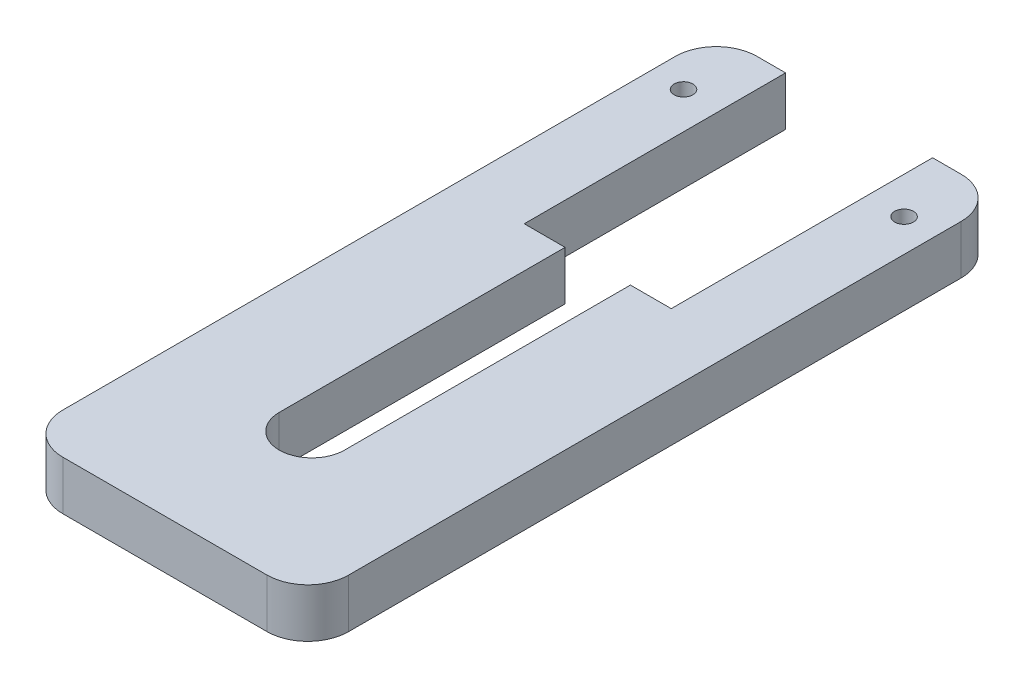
ISO-10303-21;
HEADER;
FILE_DESCRIPTION(('STEP AP214'),'2;1');
FILE_NAME('part.step','',(''),(''),'','','');
FILE_SCHEMA(('AUTOMOTIVE_DESIGN { 1 0 10303 214 1 1 1 1 }'));
ENDSEC;
DATA;
#1=APPLICATION_CONTEXT('core data for automotive mechanical design processes');
#2=APPLICATION_PROTOCOL_DEFINITION('international standard','automotive_design',2000,#1);
#3=PRODUCT_CONTEXT('',#1,'mechanical');
#4=PRODUCT('Part','Part','',(#3));
#5=PRODUCT_RELATED_PRODUCT_CATEGORY('part','',(#4));
#6=PRODUCT_DEFINITION_FORMATION('','',#4);
#7=PRODUCT_DEFINITION_CONTEXT('part definition',#1,'design');
#8=PRODUCT_DEFINITION('design','',#6,#7);
#9=PRODUCT_DEFINITION_SHAPE('','',#8);
#10=(LENGTH_UNIT() NAMED_UNIT(*) SI_UNIT(.MILLI.,.METRE.));
#11=(NAMED_UNIT(*) PLANE_ANGLE_UNIT() SI_UNIT($,.RADIAN.));
#12=(NAMED_UNIT(*) SI_UNIT($,.STERADIAN.) SOLID_ANGLE_UNIT());
#13=UNCERTAINTY_MEASURE_WITH_UNIT(LENGTH_MEASURE(1.E-05),#10,'distance_accuracy_value','');
#14=(GEOMETRIC_REPRESENTATION_CONTEXT(3) GLOBAL_UNCERTAINTY_ASSIGNED_CONTEXT((#13)) GLOBAL_UNIT_ASSIGNED_CONTEXT((#10,
#11,#12)) REPRESENTATION_CONTEXT('',''));
#15=CARTESIAN_POINT('',(0.,0.,0.));
#16=DIRECTION('',(0.,0.,1.));
#17=DIRECTION('',(1.,0.,0.));
#18=AXIS2_PLACEMENT_3D('',#15,#16,#17);
#19=CARTESIAN_POINT('',(-12.5,6.,-5.));
#20=DIRECTION('',(0.,1.,0.));
#21=DIRECTION('',(0.,0.,1.));
#22=AXIS2_PLACEMENT_3D('',#19,#20,#21);
#23=PLANE('',#22);
#24=CARTESIAN_POINT('',(-13.5,6.,-77.));
#25=DIRECTION('',(0.,1.,0.));
#26=DIRECTION('',(0.,0.,1.));
#27=AXIS2_PLACEMENT_3D('',#24,#25,#26);
#28=CIRCLE('',#27,1.15);
#29=CARTESIAN_POINT('',(-13.5,6.,-75.85));
#30=VERTEX_POINT('',#29);
#31=EDGE_CURVE('E182',#30,#30,#28,.T.);
#32=ORIENTED_EDGE('',*,*,#31,.F.);
#33=EDGE_LOOP('',(#32));
#34=FACE_BOUND('',#33,.T.);
#35=CARTESIAN_POINT('',(-12.5,6.,-5.));
#36=DIRECTION('',(0.,1.,0.));
#37=DIRECTION('',(0.,0.,1.));
#38=AXIS2_PLACEMENT_3D('',#35,#36,#37);
#39=CIRCLE('',#38,5.);
#40=CARTESIAN_POINT('',(-17.5,6.,-5.));
#41=VERTEX_POINT('',#40);
#42=CARTESIAN_POINT('',(-12.5,6.,0.));
#43=VERTEX_POINT('',#42);
#44=EDGE_CURVE('E209',#41,#43,#39,.T.);
#45=ORIENTED_EDGE('',*,*,#44,.T.);
#46=DIRECTION('',(1.,0.,0.));
#47=VECTOR('',#46,1.);
#48=CARTESIAN_POINT('',(-12.5,6.,0.));
#49=LINE('',#48,#47);
#50=CARTESIAN_POINT('',(12.5,6.,0.));
#51=VERTEX_POINT('',#50);
#52=EDGE_CURVE('E117',#43,#51,#49,.T.);
#53=ORIENTED_EDGE('',*,*,#52,.T.);
#54=CARTESIAN_POINT('',(12.5,6.,-5.));
#55=DIRECTION('',(0.,1.,0.));
#56=DIRECTION('',(0.,0.,1.));
#57=AXIS2_PLACEMENT_3D('',#54,#55,#56);
#58=CIRCLE('',#57,5.);
#59=CARTESIAN_POINT('',(17.5,6.,-5.));
#60=VERTEX_POINT('',#59);
#61=EDGE_CURVE('E248',#51,#60,#58,.T.);
#62=ORIENTED_EDGE('',*,*,#61,.T.);
#63=DIRECTION('',(0.,0.,-1.));
#64=VECTOR('',#63,1.);
#65=CARTESIAN_POINT('',(17.5,6.,-80.));
#66=LINE('',#65,#64);
#67=CARTESIAN_POINT('',(17.5,6.,-80.));
#68=VERTEX_POINT('',#67);
#69=EDGE_CURVE('E267',#60,#68,#66,.T.);
#70=ORIENTED_EDGE('',*,*,#69,.T.);
#71=CARTESIAN_POINT('',(12.5,6.,-80.));
#72=DIRECTION('',(0.,1.,0.));
#73=DIRECTION('',(0.,0.,1.));
#74=AXIS2_PLACEMENT_3D('',#71,#72,#73);
#75=CIRCLE('',#74,5.);
#76=CARTESIAN_POINT('',(12.5,6.,-85.));
#77=VERTEX_POINT('',#76);
#78=EDGE_CURVE('E264',#68,#77,#75,.T.);
#79=ORIENTED_EDGE('',*,*,#78,.T.);
#80=DIRECTION('',(-1.,0.,0.));
#81=VECTOR('',#80,1.);
#82=CARTESIAN_POINT('',(12.5,6.,-85.));
#83=LINE('',#82,#81);
#84=CARTESIAN_POINT('',(8.99999999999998,6.,-85.));
#85=VERTEX_POINT('',#84);
#86=EDGE_CURVE('E266',#77,#85,#83,.T.);
#87=ORIENTED_EDGE('',*,*,#86,.T.);
#88=DIRECTION('',(0.,0.,1.));
#89=VECTOR('',#88,1.);
#90=CARTESIAN_POINT('',(8.99999999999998,6.,-85.));
#91=LINE('',#90,#89);
#92=CARTESIAN_POINT('',(9.,6.,-53.));
#93=VERTEX_POINT('',#92);
#94=EDGE_CURVE('E269',#85,#93,#91,.T.);
#95=ORIENTED_EDGE('',*,*,#94,.T.);
#96=DIRECTION('',(-1.,0.,0.));
#97=VECTOR('',#96,1.);
#98=CARTESIAN_POINT('',(3.99999999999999,6.,-53.));
#99=LINE('',#98,#97);
#100=CARTESIAN_POINT('',(3.99999999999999,6.,-53.));
#101=VERTEX_POINT('',#100);
#102=EDGE_CURVE('E275',#93,#101,#99,.T.);
#103=ORIENTED_EDGE('',*,*,#102,.T.);
#104=DIRECTION('',(0.,0.,1.));
#105=VECTOR('',#104,1.);
#106=CARTESIAN_POINT('',(3.99999999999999,6.,-53.));
#107=LINE('',#106,#105);
#108=CARTESIAN_POINT('',(4.,6.,-18.));
#109=VERTEX_POINT('',#108);
#110=EDGE_CURVE('E277',#101,#109,#107,.T.);
#111=ORIENTED_EDGE('',*,*,#110,.T.);
#112=CARTESIAN_POINT('',(0.,6.,-18.));
#113=DIRECTION('',(0.,-1.,0.));
#114=DIRECTION('',(0.,0.,1.));
#115=AXIS2_PLACEMENT_3D('',#112,#113,#114);
#116=CIRCLE('',#115,4.);
#117=CARTESIAN_POINT('',(-4.,6.,-18.));
#118=VERTEX_POINT('',#117);
#119=EDGE_CURVE('E279',#109,#118,#116,.T.);
#120=ORIENTED_EDGE('',*,*,#119,.T.);
#121=DIRECTION('',(0.,0.,-1.));
#122=VECTOR('',#121,1.);
#123=CARTESIAN_POINT('',(-4.00000000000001,6.,-53.));
#124=LINE('',#123,#122);
#125=CARTESIAN_POINT('',(-4.00000000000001,6.,-53.));
#126=VERTEX_POINT('',#125);
#127=EDGE_CURVE('E281',#118,#126,#124,.T.);
#128=ORIENTED_EDGE('',*,*,#127,.T.);
#129=DIRECTION('',(-1.,0.,0.));
#130=VECTOR('',#129,1.);
#131=CARTESIAN_POINT('',(-9.00000000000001,6.,-53.));
#132=LINE('',#131,#130);
#133=CARTESIAN_POINT('',(-9.00000000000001,6.,-53.));
#134=VERTEX_POINT('',#133);
#135=EDGE_CURVE('E283',#126,#134,#132,.T.);
#136=ORIENTED_EDGE('',*,*,#135,.T.);
#137=DIRECTION('',(0.,0.,-1.));
#138=VECTOR('',#137,1.);
#139=CARTESIAN_POINT('',(-9.,6.,-85.));
#140=LINE('',#139,#138);
#141=CARTESIAN_POINT('',(-9.,6.,-85.));
#142=VERTEX_POINT('',#141);
#143=EDGE_CURVE('E160',#134,#142,#140,.T.);
#144=ORIENTED_EDGE('',*,*,#143,.T.);
#145=DIRECTION('',(-1.,0.,0.));
#146=VECTOR('',#145,1.);
#147=CARTESIAN_POINT('',(-12.5,6.,-85.));
#148=LINE('',#147,#146);
#149=CARTESIAN_POINT('',(-12.5,6.,-85.));
#150=VERTEX_POINT('',#149);
#151=EDGE_CURVE('E154',#142,#150,#148,.T.);
#152=ORIENTED_EDGE('',*,*,#151,.T.);
#153=CARTESIAN_POINT('',(-12.5,6.,-80.));
#154=DIRECTION('',(0.,1.,0.));
#155=DIRECTION('',(0.,0.,1.));
#156=AXIS2_PLACEMENT_3D('',#153,#154,#155);
#157=CIRCLE('',#156,5.);
#158=CARTESIAN_POINT('',(-17.5,6.,-80.));
#159=VERTEX_POINT('',#158);
#160=EDGE_CURVE('E158',#150,#159,#157,.T.);
#161=ORIENTED_EDGE('',*,*,#160,.T.);
#162=DIRECTION('',(0.,0.,1.));
#163=VECTOR('',#162,1.);
#164=CARTESIAN_POINT('',(-17.5,6.,-80.));
#165=LINE('',#164,#163);
#166=EDGE_CURVE('E50',#159,#41,#165,.T.);
#167=ORIENTED_EDGE('',*,*,#166,.T.);
#168=EDGE_LOOP('',(#45,#53,#62,#70,#79,#87,#95,#103,#111,#120,#128,#136,#144,#152,#161,#167));
#169=FACE_BOUND('',#168,.T.);
#170=CARTESIAN_POINT('',(13.5,6.,-77.));
#171=DIRECTION('',(0.,1.,0.));
#172=DIRECTION('',(0.,0.,-1.));
#173=AXIS2_PLACEMENT_3D('',#170,#171,#172);
#174=CIRCLE('',#173,1.15);
#175=CARTESIAN_POINT('',(13.5,6.,-78.15));
#176=VERTEX_POINT('',#175);
#177=EDGE_CURVE('E326',#176,#176,#174,.T.);
#178=ORIENTED_EDGE('',*,*,#177,.F.);
#179=EDGE_LOOP('',(#178));
#180=FACE_BOUND('',#179,.T.);
#181=ADVANCED_FACE('F33',(#34,#169,#180),#23,.T.);
#182=CARTESIAN_POINT('',(-12.5,0.,-5.));
#183=DIRECTION('',(0.,1.,0.));
#184=DIRECTION('',(0.,0.,1.));
#185=AXIS2_PLACEMENT_3D('',#182,#183,#184);
#186=PLANE('',#185);
#187=CARTESIAN_POINT('',(-13.5,0.,-77.));
#188=DIRECTION('',(0.,1.,0.));
#189=DIRECTION('',(0.,0.,1.));
#190=AXIS2_PLACEMENT_3D('',#187,#188,#189);
#191=CIRCLE('',#190,1.15);
#192=CARTESIAN_POINT('',(-13.5,0.,-75.85));
#193=VERTEX_POINT('',#192);
#194=EDGE_CURVE('E331',#193,#193,#191,.T.);
#195=ORIENTED_EDGE('',*,*,#194,.T.);
#196=EDGE_LOOP('',(#195));
#197=FACE_BOUND('',#196,.T.);
#198=CARTESIAN_POINT('',(-12.5,0.,-5.));
#199=DIRECTION('',(0.,1.,0.));
#200=DIRECTION('',(0.,0.,1.));
#201=AXIS2_PLACEMENT_3D('',#198,#199,#200);
#202=CIRCLE('',#201,5.);
#203=CARTESIAN_POINT('',(-17.5,0.,-5.));
#204=VERTEX_POINT('',#203);
#205=CARTESIAN_POINT('',(-12.5,0.,0.));
#206=VERTEX_POINT('',#205);
#207=EDGE_CURVE('E178',#204,#206,#202,.T.);
#208=ORIENTED_EDGE('',*,*,#207,.F.);
#209=DIRECTION('',(0.,0.,1.));
#210=VECTOR('',#209,1.);
#211=CARTESIAN_POINT('',(-17.5,0.,-80.));
#212=LINE('',#211,#210);
#213=CARTESIAN_POINT('',(-17.5,0.,-80.));
#214=VERTEX_POINT('',#213);
#215=EDGE_CURVE('E109',#214,#204,#212,.T.);
#216=ORIENTED_EDGE('',*,*,#215,.F.);
#217=CARTESIAN_POINT('',(-12.5,0.,-80.));
#218=DIRECTION('',(0.,1.,0.));
#219=DIRECTION('',(0.,0.,1.));
#220=AXIS2_PLACEMENT_3D('',#217,#218,#219);
#221=CIRCLE('',#220,5.);
#222=CARTESIAN_POINT('',(-12.5,0.,-85.));
#223=VERTEX_POINT('',#222);
#224=EDGE_CURVE('E103',#223,#214,#221,.T.);
#225=ORIENTED_EDGE('',*,*,#224,.F.);
#226=DIRECTION('',(-1.,0.,0.));
#227=VECTOR('',#226,1.);
#228=CARTESIAN_POINT('',(-12.5,0.,-85.));
#229=LINE('',#228,#227);
#230=CARTESIAN_POINT('',(-9.,0.,-85.));
#231=VERTEX_POINT('',#230);
#232=EDGE_CURVE('E168',#231,#223,#229,.T.);
#233=ORIENTED_EDGE('',*,*,#232,.F.);
#234=DIRECTION('',(0.,0.,-1.));
#235=VECTOR('',#234,1.);
#236=CARTESIAN_POINT('',(-9.,0.,-85.));
#237=LINE('',#236,#235);
#238=CARTESIAN_POINT('',(-9.00000000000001,0.,-53.));
#239=VERTEX_POINT('',#238);
#240=EDGE_CURVE('E204',#239,#231,#237,.T.);
#241=ORIENTED_EDGE('',*,*,#240,.F.);
#242=DIRECTION('',(-1.,0.,0.));
#243=VECTOR('',#242,1.);
#244=CARTESIAN_POINT('',(-9.00000000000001,0.,-53.));
#245=LINE('',#244,#243);
#246=CARTESIAN_POINT('',(-4.00000000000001,0.,-53.));
#247=VERTEX_POINT('',#246);
#248=EDGE_CURVE('E202',#247,#239,#245,.T.);
#249=ORIENTED_EDGE('',*,*,#248,.F.);
#250=DIRECTION('',(0.,0.,-1.));
#251=VECTOR('',#250,1.);
#252=CARTESIAN_POINT('',(-4.00000000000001,0.,-53.));
#253=LINE('',#252,#251);
#254=CARTESIAN_POINT('',(-4.,0.,-18.));
#255=VERTEX_POINT('',#254);
#256=EDGE_CURVE('E200',#255,#247,#253,.T.);
#257=ORIENTED_EDGE('',*,*,#256,.F.);
#258=CARTESIAN_POINT('',(0.,0.,-18.));
#259=DIRECTION('',(0.,-1.,0.));
#260=DIRECTION('',(0.,0.,1.));
#261=AXIS2_PLACEMENT_3D('',#258,#259,#260);
#262=CIRCLE('',#261,4.);
#263=CARTESIAN_POINT('',(4.,0.,-18.));
#264=VERTEX_POINT('',#263);
#265=EDGE_CURVE('E198',#264,#255,#262,.T.);
#266=ORIENTED_EDGE('',*,*,#265,.F.);
#267=DIRECTION('',(0.,0.,1.));
#268=VECTOR('',#267,1.);
#269=CARTESIAN_POINT('',(3.99999999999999,0.,-53.));
#270=LINE('',#269,#268);
#271=CARTESIAN_POINT('',(3.99999999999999,0.,-53.));
#272=VERTEX_POINT('',#271);
#273=EDGE_CURVE('E196',#272,#264,#270,.T.);
#274=ORIENTED_EDGE('',*,*,#273,.F.);
#275=DIRECTION('',(-1.,0.,0.));
#276=VECTOR('',#275,1.);
#277=CARTESIAN_POINT('',(3.99999999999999,0.,-53.));
#278=LINE('',#277,#276);
#279=CARTESIAN_POINT('',(9.,0.,-53.));
#280=VERTEX_POINT('',#279);
#281=EDGE_CURVE('E194',#280,#272,#278,.T.);
#282=ORIENTED_EDGE('',*,*,#281,.F.);
#283=DIRECTION('',(0.,0.,1.));
#284=VECTOR('',#283,1.);
#285=CARTESIAN_POINT('',(8.99999999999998,0.,-85.));
#286=LINE('',#285,#284);
#287=CARTESIAN_POINT('',(8.99999999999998,0.,-85.));
#288=VERTEX_POINT('',#287);
#289=EDGE_CURVE('E192',#288,#280,#286,.T.);
#290=ORIENTED_EDGE('',*,*,#289,.F.);
#291=DIRECTION('',(-1.,0.,0.));
#292=VECTOR('',#291,1.);
#293=CARTESIAN_POINT('',(12.5,0.,-85.));
#294=LINE('',#293,#292);
#295=CARTESIAN_POINT('',(12.5,0.,-85.));
#296=VERTEX_POINT('',#295);
#297=EDGE_CURVE('E190',#296,#288,#294,.T.);
#298=ORIENTED_EDGE('',*,*,#297,.F.);
#299=CARTESIAN_POINT('',(12.5,0.,-80.));
#300=DIRECTION('',(0.,1.,0.));
#301=DIRECTION('',(0.,0.,1.));
#302=AXIS2_PLACEMENT_3D('',#299,#300,#301);
#303=CIRCLE('',#302,5.);
#304=CARTESIAN_POINT('',(17.5,0.,-80.));
#305=VERTEX_POINT('',#304);
#306=EDGE_CURVE('E188',#305,#296,#303,.T.);
#307=ORIENTED_EDGE('',*,*,#306,.F.);
#308=DIRECTION('',(0.,0.,-1.));
#309=VECTOR('',#308,1.);
#310=CARTESIAN_POINT('',(17.5,0.,-80.));
#311=LINE('',#310,#309);
#312=CARTESIAN_POINT('',(17.5,0.,-5.));
#313=VERTEX_POINT('',#312);
#314=EDGE_CURVE('E186',#313,#305,#311,.T.);
#315=ORIENTED_EDGE('',*,*,#314,.F.);
#316=CARTESIAN_POINT('',(12.5,0.,-5.));
#317=DIRECTION('',(0.,1.,0.));
#318=DIRECTION('',(0.,0.,1.));
#319=AXIS2_PLACEMENT_3D('',#316,#317,#318);
#320=CIRCLE('',#319,5.);
#321=CARTESIAN_POINT('',(12.5,0.,0.));
#322=VERTEX_POINT('',#321);
#323=EDGE_CURVE('E184',#322,#313,#320,.T.);
#324=ORIENTED_EDGE('',*,*,#323,.F.);
#325=DIRECTION('',(1.,0.,0.));
#326=VECTOR('',#325,1.);
#327=CARTESIAN_POINT('',(-12.5,0.,0.));
#328=LINE('',#327,#326);
#329=EDGE_CURVE('E181',#206,#322,#328,.T.);
#330=ORIENTED_EDGE('',*,*,#329,.F.);
#331=EDGE_LOOP('',(#208,#216,#225,#233,#241,#249,#257,#266,#274,#282,#290,#298,#307,#315,#324,#330));
#332=FACE_BOUND('',#331,.T.);
#333=CARTESIAN_POINT('',(13.5,0.,-77.));
#334=DIRECTION('',(0.,1.,0.));
#335=DIRECTION('',(0.,0.,-1.));
#336=AXIS2_PLACEMENT_3D('',#333,#334,#335);
#337=CIRCLE('',#336,1.15);
#338=CARTESIAN_POINT('',(13.5,0.,-78.15));
#339=VERTEX_POINT('',#338);
#340=EDGE_CURVE('E329',#339,#339,#337,.T.);
#341=ORIENTED_EDGE('',*,*,#340,.T.);
#342=EDGE_LOOP('',(#341));
#343=FACE_BOUND('',#342,.T.);
#344=ADVANCED_FACE('F252',(#197,#332,#343),#186,.F.);
#345=CARTESIAN_POINT('',(-12.5,6.,-5.));
#346=DIRECTION('',(0.,-1.,0.));
#347=DIRECTION('',(0.,0.,-1.));
#348=AXIS2_PLACEMENT_3D('',#345,#346,#347);
#349=CYLINDRICAL_SURFACE('',#348,5.);
#350=ORIENTED_EDGE('',*,*,#207,.T.);
#351=DIRECTION('',(0.,-1.,0.));
#352=VECTOR('',#351,1.);
#353=CARTESIAN_POINT('',(-12.5,6.,0.));
#354=LINE('',#353,#352);
#355=EDGE_CURVE('E11',#43,#206,#354,.T.);
#356=ORIENTED_EDGE('',*,*,#355,.F.);
#357=ORIENTED_EDGE('',*,*,#44,.F.);
#358=DIRECTION('',(0.,-1.,0.));
#359=VECTOR('',#358,1.);
#360=CARTESIAN_POINT('',(-17.5,6.,-5.));
#361=LINE('',#360,#359);
#362=EDGE_CURVE('E174',#41,#204,#361,.T.);
#363=ORIENTED_EDGE('',*,*,#362,.T.);
#364=EDGE_LOOP('',(#350,#356,#357,#363));
#365=FACE_BOUND('',#364,.T.);
#366=ADVANCED_FACE('F35',(#365),#349,.T.);
#367=CARTESIAN_POINT('',(-12.5,6.,0.));
#368=DIRECTION('',(0.,0.,-1.));
#369=DIRECTION('',(-1.,0.,0.));
#370=AXIS2_PLACEMENT_3D('',#367,#368,#369);
#371=PLANE('',#370);
#372=ORIENTED_EDGE('',*,*,#329,.T.);
#373=DIRECTION('',(0.,-1.,0.));
#374=VECTOR('',#373,1.);
#375=CARTESIAN_POINT('',(12.5,6.,0.));
#376=LINE('',#375,#374);
#377=EDGE_CURVE('E42',#51,#322,#376,.T.);
#378=ORIENTED_EDGE('',*,*,#377,.F.);
#379=ORIENTED_EDGE('',*,*,#52,.F.);
#380=ORIENTED_EDGE('',*,*,#355,.T.);
#381=EDGE_LOOP('',(#372,#378,#379,#380));
#382=FACE_BOUND('',#381,.T.);
#383=ADVANCED_FACE('F464',(#382),#371,.F.);
#384=CARTESIAN_POINT('',(12.5,6.,-5.));
#385=DIRECTION('',(0.,-1.,0.));
#386=DIRECTION('',(0.,0.,-1.));
#387=AXIS2_PLACEMENT_3D('',#384,#385,#386);
#388=CYLINDRICAL_SURFACE('',#387,5.);
#389=ORIENTED_EDGE('',*,*,#323,.T.);
#390=DIRECTION('',(0.,-1.,0.));
#391=VECTOR('',#390,1.);
#392=CARTESIAN_POINT('',(17.5,6.,-5.));
#393=LINE('',#392,#391);
#394=EDGE_CURVE('E240',#60,#313,#393,.T.);
#395=ORIENTED_EDGE('',*,*,#394,.F.);
#396=ORIENTED_EDGE('',*,*,#61,.F.);
#397=ORIENTED_EDGE('',*,*,#377,.T.);
#398=EDGE_LOOP('',(#389,#395,#396,#397));
#399=FACE_BOUND('',#398,.T.);
#400=ADVANCED_FACE('F246',(#399),#388,.T.);
#401=CARTESIAN_POINT('',(17.5,6.,-80.));
#402=DIRECTION('',(-1.,0.,0.));
#403=DIRECTION('',(0.,0.,1.));
#404=AXIS2_PLACEMENT_3D('',#401,#402,#403);
#405=PLANE('',#404);
#406=ORIENTED_EDGE('',*,*,#314,.T.);
#407=DIRECTION('',(0.,-1.,0.));
#408=VECTOR('',#407,1.);
#409=CARTESIAN_POINT('',(17.5,6.,-80.));
#410=LINE('',#409,#408);
#411=EDGE_CURVE('E237',#68,#305,#410,.T.);
#412=ORIENTED_EDGE('',*,*,#411,.F.);
#413=ORIENTED_EDGE('',*,*,#69,.F.);
#414=ORIENTED_EDGE('',*,*,#394,.T.);
#415=EDGE_LOOP('',(#406,#412,#413,#414));
#416=FACE_BOUND('',#415,.T.);
#417=ADVANCED_FACE('F258',(#416),#405,.F.);
#418=CARTESIAN_POINT('',(12.5,6.,-80.));
#419=DIRECTION('',(0.,-1.,0.));
#420=DIRECTION('',(0.,0.,-1.));
#421=AXIS2_PLACEMENT_3D('',#418,#419,#420);
#422=CYLINDRICAL_SURFACE('',#421,5.);
#423=ORIENTED_EDGE('',*,*,#306,.T.);
#424=DIRECTION('',(0.,-1.,0.));
#425=VECTOR('',#424,1.);
#426=CARTESIAN_POINT('',(12.5,6.,-85.));
#427=LINE('',#426,#425);
#428=EDGE_CURVE('E234',#77,#296,#427,.T.);
#429=ORIENTED_EDGE('',*,*,#428,.F.);
#430=ORIENTED_EDGE('',*,*,#78,.F.);
#431=ORIENTED_EDGE('',*,*,#411,.T.);
#432=EDGE_LOOP('',(#423,#429,#430,#431));
#433=FACE_BOUND('',#432,.T.);
#434=ADVANCED_FACE('F262',(#433),#422,.T.);
#435=CARTESIAN_POINT('',(12.5,6.,-85.));
#436=DIRECTION('',(0.,0.,1.));
#437=DIRECTION('',(1.,0.,0.));
#438=AXIS2_PLACEMENT_3D('',#435,#436,#437);
#439=PLANE('',#438);
#440=ORIENTED_EDGE('',*,*,#297,.T.);
#441=DIRECTION('',(0.,-1.,0.));
#442=VECTOR('',#441,1.);
#443=CARTESIAN_POINT('',(8.99999999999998,6.,-85.));
#444=LINE('',#443,#442);
#445=EDGE_CURVE('E231',#85,#288,#444,.T.);
#446=ORIENTED_EDGE('',*,*,#445,.F.);
#447=ORIENTED_EDGE('',*,*,#86,.F.);
#448=ORIENTED_EDGE('',*,*,#428,.T.);
#449=EDGE_LOOP('',(#440,#446,#447,#448));
#450=FACE_BOUND('',#449,.T.);
#451=ADVANCED_FACE('F429',(#450),#439,.F.);
#452=CARTESIAN_POINT('',(8.99999999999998,6.,-85.));
#453=DIRECTION('',(1.,0.,0.));
#454=DIRECTION('',(0.,0.,-1.));
#455=AXIS2_PLACEMENT_3D('',#452,#453,#454);
#456=PLANE('',#455);
#457=ORIENTED_EDGE('',*,*,#289,.T.);
#458=DIRECTION('',(0.,-1.,0.));
#459=VECTOR('',#458,1.);
#460=CARTESIAN_POINT('',(9.,6.,-53.));
#461=LINE('',#460,#459);
#462=EDGE_CURVE('E228',#93,#280,#461,.T.);
#463=ORIENTED_EDGE('',*,*,#462,.F.);
#464=ORIENTED_EDGE('',*,*,#94,.F.);
#465=ORIENTED_EDGE('',*,*,#445,.T.);
#466=EDGE_LOOP('',(#457,#463,#464,#465));
#467=FACE_BOUND('',#466,.T.);
#468=ADVANCED_FACE('F419',(#467),#456,.F.);
#469=CARTESIAN_POINT('',(3.99999999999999,6.,-53.));
#470=DIRECTION('',(0.,0.,1.));
#471=DIRECTION('',(1.,0.,0.));
#472=AXIS2_PLACEMENT_3D('',#469,#470,#471);
#473=PLANE('',#472);
#474=ORIENTED_EDGE('',*,*,#281,.T.);
#475=DIRECTION('',(0.,-1.,0.));
#476=VECTOR('',#475,1.);
#477=CARTESIAN_POINT('',(3.99999999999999,6.,-53.));
#478=LINE('',#477,#476);
#479=EDGE_CURVE('E225',#101,#272,#478,.T.);
#480=ORIENTED_EDGE('',*,*,#479,.F.);
#481=ORIENTED_EDGE('',*,*,#102,.F.);
#482=ORIENTED_EDGE('',*,*,#462,.T.);
#483=EDGE_LOOP('',(#474,#480,#481,#482));
#484=FACE_BOUND('',#483,.T.);
#485=ADVANCED_FACE('F409',(#484),#473,.F.);
#486=CARTESIAN_POINT('',(3.99999999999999,6.,-53.));
#487=DIRECTION('',(1.,0.,0.));
#488=DIRECTION('',(0.,0.,-1.));
#489=AXIS2_PLACEMENT_3D('',#486,#487,#488);
#490=PLANE('',#489);
#491=ORIENTED_EDGE('',*,*,#273,.T.);
#492=DIRECTION('',(0.,-1.,0.));
#493=VECTOR('',#492,1.);
#494=CARTESIAN_POINT('',(4.,6.,-18.));
#495=LINE('',#494,#493);
#496=EDGE_CURVE('E222',#109,#264,#495,.T.);
#497=ORIENTED_EDGE('',*,*,#496,.F.);
#498=ORIENTED_EDGE('',*,*,#110,.F.);
#499=ORIENTED_EDGE('',*,*,#479,.T.);
#500=EDGE_LOOP('',(#491,#497,#498,#499));
#501=FACE_BOUND('',#500,.T.);
#502=ADVANCED_FACE('F399',(#501),#490,.F.);
#503=CARTESIAN_POINT('',(0.,6.,-18.));
#504=DIRECTION('',(0.,-1.,0.));
#505=DIRECTION('',(0.,0.,-1.));
#506=AXIS2_PLACEMENT_3D('',#503,#504,#505);
#507=CYLINDRICAL_SURFACE('',#506,4.);
#508=ORIENTED_EDGE('',*,*,#265,.T.);
#509=DIRECTION('',(0.,-1.,0.));
#510=VECTOR('',#509,1.);
#511=CARTESIAN_POINT('',(-4.,6.,-18.));
#512=LINE('',#511,#510);
#513=EDGE_CURVE('E219',#118,#255,#512,.T.);
#514=ORIENTED_EDGE('',*,*,#513,.F.);
#515=ORIENTED_EDGE('',*,*,#119,.F.);
#516=ORIENTED_EDGE('',*,*,#496,.T.);
#517=EDGE_LOOP('',(#508,#514,#515,#516));
#518=FACE_BOUND('',#517,.T.);
#519=ADVANCED_FACE('F389',(#518),#507,.F.);
#520=CARTESIAN_POINT('',(-4.00000000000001,6.,-53.));
#521=DIRECTION('',(-1.,0.,0.));
#522=DIRECTION('',(0.,0.,1.));
#523=AXIS2_PLACEMENT_3D('',#520,#521,#522);
#524=PLANE('',#523);
#525=ORIENTED_EDGE('',*,*,#256,.T.);
#526=DIRECTION('',(0.,-1.,0.));
#527=VECTOR('',#526,1.);
#528=CARTESIAN_POINT('',(-4.00000000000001,6.,-53.));
#529=LINE('',#528,#527);
#530=EDGE_CURVE('E216',#126,#247,#529,.T.);
#531=ORIENTED_EDGE('',*,*,#530,.F.);
#532=ORIENTED_EDGE('',*,*,#127,.F.);
#533=ORIENTED_EDGE('',*,*,#513,.T.);
#534=EDGE_LOOP('',(#525,#531,#532,#533));
#535=FACE_BOUND('',#534,.T.);
#536=ADVANCED_FACE('F380',(#535),#524,.F.);
#537=CARTESIAN_POINT('',(-9.00000000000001,6.,-53.));
#538=DIRECTION('',(0.,0.,1.));
#539=DIRECTION('',(1.,0.,0.));
#540=AXIS2_PLACEMENT_3D('',#537,#538,#539);
#541=PLANE('',#540);
#542=ORIENTED_EDGE('',*,*,#248,.T.);
#543=DIRECTION('',(0.,-1.,0.));
#544=VECTOR('',#543,1.);
#545=CARTESIAN_POINT('',(-9.00000000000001,6.,-53.));
#546=LINE('',#545,#544);
#547=EDGE_CURVE('E213',#134,#239,#546,.T.);
#548=ORIENTED_EDGE('',*,*,#547,.F.);
#549=ORIENTED_EDGE('',*,*,#135,.F.);
#550=ORIENTED_EDGE('',*,*,#530,.T.);
#551=EDGE_LOOP('',(#542,#548,#549,#550));
#552=FACE_BOUND('',#551,.T.);
#553=ADVANCED_FACE('F289',(#552),#541,.F.);
#554=CARTESIAN_POINT('',(-9.,6.,-85.));
#555=DIRECTION('',(-1.,0.,0.));
#556=DIRECTION('',(0.,0.,1.));
#557=AXIS2_PLACEMENT_3D('',#554,#555,#556);
#558=PLANE('',#557);
#559=ORIENTED_EDGE('',*,*,#240,.T.);
#560=DIRECTION('',(0.,-1.,0.));
#561=VECTOR('',#560,1.);
#562=CARTESIAN_POINT('',(-9.,6.,-85.));
#563=LINE('',#562,#561);
#564=EDGE_CURVE('E169',#142,#231,#563,.T.);
#565=ORIENTED_EDGE('',*,*,#564,.F.);
#566=ORIENTED_EDGE('',*,*,#143,.F.);
#567=ORIENTED_EDGE('',*,*,#547,.T.);
#568=EDGE_LOOP('',(#559,#565,#566,#567));
#569=FACE_BOUND('',#568,.T.);
#570=ADVANCED_FACE('F293',(#569),#558,.F.);
#571=CARTESIAN_POINT('',(-12.5,6.,-85.));
#572=DIRECTION('',(0.,0.,1.));
#573=DIRECTION('',(1.,0.,0.));
#574=AXIS2_PLACEMENT_3D('',#571,#572,#573);
#575=PLANE('',#574);
#576=ORIENTED_EDGE('',*,*,#232,.T.);
#577=DIRECTION('',(0.,-1.,0.));
#578=VECTOR('',#577,1.);
#579=CARTESIAN_POINT('',(-12.5,6.,-85.));
#580=LINE('',#579,#578);
#581=EDGE_CURVE('E165',#150,#223,#580,.T.);
#582=ORIENTED_EDGE('',*,*,#581,.F.);
#583=ORIENTED_EDGE('',*,*,#151,.F.);
#584=ORIENTED_EDGE('',*,*,#564,.T.);
#585=EDGE_LOOP('',(#576,#582,#583,#584));
#586=FACE_BOUND('',#585,.T.);
#587=ADVANCED_FACE('F166',(#586),#575,.F.);
#588=CARTESIAN_POINT('',(-12.5,6.,-80.));
#589=DIRECTION('',(0.,-1.,0.));
#590=DIRECTION('',(0.,0.,-1.));
#591=AXIS2_PLACEMENT_3D('',#588,#589,#590);
#592=CYLINDRICAL_SURFACE('',#591,5.);
#593=ORIENTED_EDGE('',*,*,#224,.T.);
#594=DIRECTION('',(0.,-1.,0.));
#595=VECTOR('',#594,1.);
#596=CARTESIAN_POINT('',(-17.5,6.,-80.));
#597=LINE('',#596,#595);
#598=EDGE_CURVE('E170',#159,#214,#597,.T.);
#599=ORIENTED_EDGE('',*,*,#598,.F.);
#600=ORIENTED_EDGE('',*,*,#160,.F.);
#601=ORIENTED_EDGE('',*,*,#581,.T.);
#602=EDGE_LOOP('',(#593,#599,#600,#601));
#603=FACE_BOUND('',#602,.T.);
#604=ADVANCED_FACE('F172',(#603),#592,.T.);
#605=CARTESIAN_POINT('',(-17.5,6.,-80.));
#606=DIRECTION('',(1.,0.,0.));
#607=DIRECTION('',(0.,0.,-1.));
#608=AXIS2_PLACEMENT_3D('',#605,#606,#607);
#609=PLANE('',#608);
#610=ORIENTED_EDGE('',*,*,#215,.T.);
#611=ORIENTED_EDGE('',*,*,#362,.F.);
#612=ORIENTED_EDGE('',*,*,#166,.F.);
#613=ORIENTED_EDGE('',*,*,#598,.T.);
#614=EDGE_LOOP('',(#610,#611,#612,#613));
#615=FACE_BOUND('',#614,.T.);
#616=ADVANCED_FACE('F297',(#615),#609,.F.);
#617=CARTESIAN_POINT('',(-13.5,6.,-77.));
#618=DIRECTION('',(0.,-1.,0.));
#619=DIRECTION('',(0.,0.,-1.));
#620=AXIS2_PLACEMENT_3D('',#617,#618,#619);
#621=CYLINDRICAL_SURFACE('',#620,1.15);
#622=ORIENTED_EDGE('',*,*,#31,.T.);
#623=EDGE_LOOP('',(#622));
#624=FACE_BOUND('',#623,.T.);
#625=ORIENTED_EDGE('',*,*,#194,.F.);
#626=EDGE_LOOP('',(#625));
#627=FACE_BOUND('',#626,.T.);
#628=ADVANCED_FACE('F299',(#624,#627),#621,.F.);
#629=CARTESIAN_POINT('',(13.5,6.,-77.));
#630=DIRECTION('',(0.,-1.,0.));
#631=DIRECTION('',(0.,0.,-1.));
#632=AXIS2_PLACEMENT_3D('',#629,#630,#631);
#633=CYLINDRICAL_SURFACE('',#632,1.15);
#634=ORIENTED_EDGE('',*,*,#177,.T.);
#635=EDGE_LOOP('',(#634));
#636=FACE_BOUND('',#635,.T.);
#637=ORIENTED_EDGE('',*,*,#340,.F.);
#638=EDGE_LOOP('',(#637));
#639=FACE_BOUND('',#638,.T.);
#640=ADVANCED_FACE('F305',(#636,#639),#633,.F.);
#641=CLOSED_SHELL('',(#181,#344,#366,#383,#400,#417,#434,#451,#468,#485,#502,#519,#536,#553,
#570,#587,#604,#616,#628,#640));
#642=MANIFOLD_SOLID_BREP('B2',#641);
#643=ADVANCED_BREP_SHAPE_REPRESENTATION('',(#18,#642),#14);
#644=SHAPE_DEFINITION_REPRESENTATION(#9,#643);
ENDSEC;
END-ISO-10303-21;
